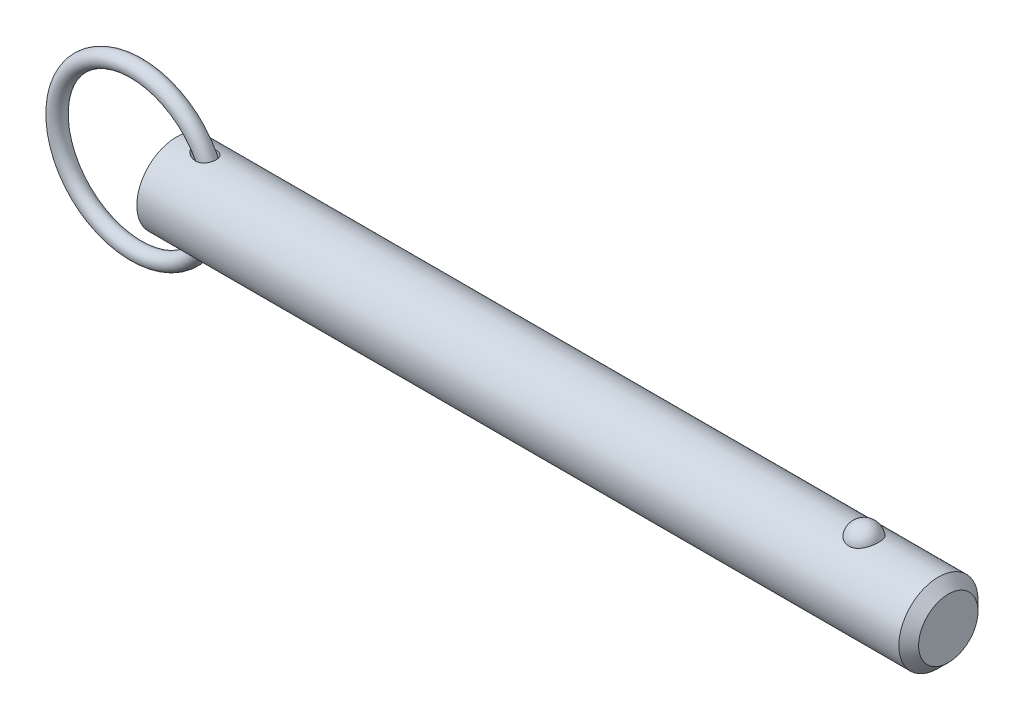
ISO-10303-21;
HEADER;
FILE_DESCRIPTION(('STEP AP214'),'2;1');
FILE_NAME('part.step','',(''),(''),'','','');
FILE_SCHEMA(('AUTOMOTIVE_DESIGN { 1 0 10303 214 1 1 1 1 }'));
ENDSEC;
DATA;
#1=APPLICATION_CONTEXT('core data for automotive mechanical design processes');
#2=APPLICATION_PROTOCOL_DEFINITION('international standard','automotive_design',2000,#1);
#3=PRODUCT_CONTEXT('',#1,'mechanical');
#4=PRODUCT('Part','Part','',(#3));
#5=PRODUCT_RELATED_PRODUCT_CATEGORY('part','',(#4));
#6=PRODUCT_DEFINITION_FORMATION('','',#4);
#7=PRODUCT_DEFINITION_CONTEXT('part definition',#1,'design');
#8=PRODUCT_DEFINITION('design','',#6,#7);
#9=PRODUCT_DEFINITION_SHAPE('','',#8);
#10=(LENGTH_UNIT() NAMED_UNIT(*) SI_UNIT(.MILLI.,.METRE.));
#11=(NAMED_UNIT(*) PLANE_ANGLE_UNIT() SI_UNIT($,.RADIAN.));
#12=(NAMED_UNIT(*) SI_UNIT($,.STERADIAN.) SOLID_ANGLE_UNIT());
#13=UNCERTAINTY_MEASURE_WITH_UNIT(LENGTH_MEASURE(1.E-05),#10,'distance_accuracy_value','');
#14=(GEOMETRIC_REPRESENTATION_CONTEXT(3) GLOBAL_UNCERTAINTY_ASSIGNED_CONTEXT((#13)) GLOBAL_UNIT_ASSIGNED_CONTEXT((#10,
#11,#12)) REPRESENTATION_CONTEXT('',''));
#15=CARTESIAN_POINT('',(0.,0.,0.));
#16=DIRECTION('',(0.,0.,1.));
#17=DIRECTION('',(1.,0.,0.));
#18=AXIS2_PLACEMENT_3D('',#15,#16,#17);
#19=CARTESIAN_POINT('',(-9.66825126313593,0.,0.));
#20=DIRECTION('',(0.,0.,1.));
#21=DIRECTION('',(1.,0.,0.));
#22=AXIS2_PLACEMENT_3D('',#19,#20,#21);
#23=TOROIDAL_SURFACE('',#22,19.05,1.905);
#24=CARTESIAN_POINT('',(11.2867487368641,0.,0.));
#25=VERTEX_POINT('',#24);
#26=VERTEX_LOOP('',#25);
#27=FACE_BOUND('',#26,.T.);
#28=ADVANCED_FACE('P0_F12',(#27),#23,.T.);
#29=CLOSED_SHELL('',(#28));
#30=MANIFOLD_SOLID_BREP('P0_B1',#29);
#31=CARTESIAN_POINT('',(0.,0.,0.));
#32=DIRECTION('',(1.,0.,0.));
#33=DIRECTION('',(0.,0.,-1.));
#34=AXIS2_PLACEMENT_3D('',#31,#32,#33);
#35=CYLINDRICAL_SURFACE('',#34,9.525);
#36=CARTESIAN_POINT('',(4.56693409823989,9.43141941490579,-1.33189820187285));
#37=CARTESIAN_POINT('',(4.70260475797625,9.41020313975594,-1.48215931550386));
#38=CARTESIAN_POINT('',(4.85555680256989,9.38755003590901,-1.61683982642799));
#39=CARTESIAN_POINT('',(5.10171959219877,9.35450554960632,-1.79512943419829));
#40=CARTESIAN_POINT('',(5.18674514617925,9.34362629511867,-1.85068909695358));
#41=CARTESIAN_POINT('',(5.3615438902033,9.32258514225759,-1.95392002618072));
#42=CARTESIAN_POINT('',(5.45131542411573,9.31242299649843,-2.00159402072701));
#43=CARTESIAN_POINT('',(5.70070211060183,9.28632120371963,-2.12033289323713));
#44=CARTESIAN_POINT('',(5.86420408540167,9.27146938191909,-2.18362944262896));
#45=CARTESIAN_POINT('',(6.19893345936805,9.24694163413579,-2.28525783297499));
#46=CARTESIAN_POINT('',(6.3701538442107,9.23726110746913,-2.32361187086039));
#47=CARTESIAN_POINT('',(6.73531776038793,9.22400982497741,-2.37575048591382));
#48=CARTESIAN_POINT('',(6.92975826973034,9.22118808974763,-2.38652934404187));
#49=CARTESIAN_POINT('',(7.21995443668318,9.22416297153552,-2.37494980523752));
#50=CARTESIAN_POINT('',(7.31643847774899,9.22635560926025,-2.366466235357));
#51=CARTESIAN_POINT('',(7.50796421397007,9.2331428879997,-2.33985028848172));
#52=CARTESIAN_POINT('',(7.6030065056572,9.23773650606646,-2.32172202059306));
#53=CARTESIAN_POINT('',(7.83273114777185,9.25183311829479,-2.26504721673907));
#54=CARTESIAN_POINT('',(7.96603028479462,9.26261470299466,-2.2209856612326));
#55=CARTESIAN_POINT('',(8.22310899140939,9.28816519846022,-2.1115730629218));
#56=CARTESIAN_POINT('',(8.34689477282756,9.30293147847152,-2.04623606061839));
#57=CARTESIAN_POINT('',(8.58136049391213,9.3349416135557,-1.89485344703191));
#58=CARTESIAN_POINT('',(8.69199721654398,9.35219324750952,-1.80874222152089));
#59=CARTESIAN_POINT('',(8.89592093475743,9.38707016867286,-1.61799188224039));
#60=CARTESIAN_POINT('',(8.98920771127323,9.40469546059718,-1.51335253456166));
#61=CARTESIAN_POINT('',(9.15057731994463,9.43713590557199,-1.29519427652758));
#62=CARTESIAN_POINT('',(9.21980158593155,9.45205440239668,-1.18253282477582));
#63=CARTESIAN_POINT('',(9.33826736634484,9.47856708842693,-0.946802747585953));
#64=CARTESIAN_POINT('',(9.38751161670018,9.49016173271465,-0.823735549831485));
#65=CARTESIAN_POINT('',(9.46423850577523,9.50859378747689,-0.57261402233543));
#66=CARTESIAN_POINT('',(9.49202393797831,9.5154972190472,-0.444656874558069));
#67=CARTESIAN_POINT('',(9.52636926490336,9.52406905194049,-0.185752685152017));
#68=CARTESIAN_POINT('',(9.53292923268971,9.52573747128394,-0.0548056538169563));
#69=CARTESIAN_POINT('',(9.52467276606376,9.52365852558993,0.20650329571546));
#70=CARTESIAN_POINT('',(9.50983454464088,9.51990564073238,0.336864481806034));
#71=CARTESIAN_POINT('',(9.45907362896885,9.50737852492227,0.593166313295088));
#72=CARTESIAN_POINT('',(9.42315106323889,9.49860432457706,0.719106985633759));
#73=CARTESIAN_POINT('',(9.3310664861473,9.4769892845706,0.96295935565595));
#74=CARTESIAN_POINT('',(9.27490839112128,9.46414923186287,1.08087260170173));
#75=CARTESIAN_POINT('',(9.14375803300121,9.43581000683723,1.30534632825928));
#76=CARTESIAN_POINT('',(9.06876720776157,9.42031103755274,1.41190767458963));
#77=CARTESIAN_POINT('',(8.90203187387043,9.38836719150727,1.61069439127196));
#78=CARTESIAN_POINT('',(8.81029913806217,9.37192298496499,1.70292975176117));
#79=CARTESIAN_POINT('',(8.6126877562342,9.33985045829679,1.87086859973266));
#80=CARTESIAN_POINT('',(8.50680947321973,9.3242221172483,1.94657251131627));
#81=CARTESIAN_POINT('',(8.28220546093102,9.29513431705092,2.08109032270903));
#82=CARTESIAN_POINT('',(8.16329919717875,9.28171415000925,2.13961034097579));
#83=CARTESIAN_POINT('',(7.91756052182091,9.25859072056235,2.23755716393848));
#84=CARTESIAN_POINT('',(7.79072606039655,9.24888842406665,2.27697900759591));
#85=CARTESIAN_POINT('',(7.52377913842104,9.23338749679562,2.33907806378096));
#86=CARTESIAN_POINT('',(7.3833476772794,9.22789571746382,2.36044900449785));
#87=CARTESIAN_POINT('',(7.1008139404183,9.22210229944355,2.3829751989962));
#88=CARTESIAN_POINT('',(6.95871103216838,9.22180269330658,2.38412253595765));
#89=CARTESIAN_POINT('',(6.65642691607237,9.22632724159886,2.36656230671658));
#90=CARTESIAN_POINT('',(6.49641694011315,9.23185415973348,2.3451317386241));
#91=CARTESIAN_POINT('',(6.18115433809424,9.24811737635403,2.28014143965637));
#92=CARTESIAN_POINT('',(6.02590710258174,9.25885936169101,2.23655754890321));
#93=CARTESIAN_POINT('',(5.69904720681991,9.28624254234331,2.12025087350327));
#94=CARTESIAN_POINT('',(5.52873601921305,9.30354853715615,2.04400672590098));
#95=CARTESIAN_POINT('',(5.20289495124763,9.34106989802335,1.86504730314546));
#96=CARTESIAN_POINT('',(5.0473596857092,9.36128419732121,1.76234172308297));
#97=CARTESIAN_POINT('',(4.79287124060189,9.39697639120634,1.55895334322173));
#98=CARTESIAN_POINT('',(4.6893870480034,9.41240250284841,1.46392900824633));
#99=CARTESIAN_POINT('',(4.4984714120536,9.44202586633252,1.25875918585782));
#100=CARTESIAN_POINT('',(4.41101129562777,9.45622528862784,1.1486413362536));
#101=CARTESIAN_POINT('',(4.27502257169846,9.47888210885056,0.940600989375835));
#102=CARTESIAN_POINT('',(4.22216329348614,9.48791121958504,0.845586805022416));
#103=CARTESIAN_POINT('',(4.13241478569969,9.50344321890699,0.648051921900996));
#104=CARTESIAN_POINT('',(4.0955118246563,9.50994827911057,0.545537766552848));
#105=CARTESIAN_POINT('',(4.04043124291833,9.51971586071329,0.334452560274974));
#106=CARTESIAN_POINT('',(4.02240728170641,9.52295176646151,0.225839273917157));
#107=CARTESIAN_POINT('',(4.00750873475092,9.52562364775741,0.00713006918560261));
#108=CARTESIAN_POINT('',(4.01062334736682,9.52506156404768,-0.102965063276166));
#109=CARTESIAN_POINT('',(4.03592967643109,9.52053221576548,-0.306944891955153));
#110=CARTESIAN_POINT('',(4.05571676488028,9.51699426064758,-0.401151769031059));
#111=CARTESIAN_POINT('',(4.10967975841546,9.5074546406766,-0.585176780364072));
#112=CARTESIAN_POINT('',(4.1438599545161,9.50145224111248,-0.674993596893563));
#113=CARTESIAN_POINT('',(4.23261356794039,9.48611703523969,-0.866116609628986));
#114=CARTESIAN_POINT('',(4.28990016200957,9.47635800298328,-0.966121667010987));
#115=CARTESIAN_POINT('',(4.4185657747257,9.45502867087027,-1.15640011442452));
#116=CARTESIAN_POINT('',(4.4899691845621,9.44345524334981,-1.24665623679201));
#117=CARTESIAN_POINT('',(4.56693409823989,9.43141941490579,-1.33189820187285));
#118=B_SPLINE_CURVE_WITH_KNOTS('',3,(#36,#37,#38,#39,#40,#41,#42,#43,#44,#45,#46,#47,#48,#49,
#50,#51,#52,#53,#54,#55,#56,#57,#58,#59,#60,#61,#62,#63,#64,#65,#66,#67,#68,#69,#70,#71,#72,#73,
#74,#75,#76,#77,#78,#79,#80,#81,#82,#83,#84,#85,#86,#87,#88,#89,#90,#91,#92,#93,#94,#95,#96,#97,
#98,#99,#100,#101,#102,#103,#104,#105,#106,#107,#108,#109,#110,#111,#112,#113,#114,#115,#116,
#117),.UNSPECIFIED.,.T.,.F.,(4,2,2,2,2,2,2,2,2,2,2,2,2,2,2,2,2,2,2,2,2,2,2,2,2,2,2,2,2,2,2,2,2,
2,2,2,2,2,2,2,4),(0.,0.609951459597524,0.916123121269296,1.22218863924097,1.74791337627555,
2.27316961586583,2.85362722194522,3.14383229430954,3.43391382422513,3.85437497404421,
4.27455920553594,4.69608835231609,5.11762282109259,5.5149005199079,5.91212379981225,
6.30363414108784,6.69514313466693,7.08705103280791,7.47895654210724,7.87078624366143,
8.26258603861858,8.65411137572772,9.04562666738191,9.44349251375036,9.84146165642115,
10.2662286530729,10.6911619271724,11.1739180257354,11.6572017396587,12.2170157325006,
12.7766249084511,13.1992556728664,13.6211226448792,13.9471990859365,14.2729943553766,
14.6014211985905,14.9296802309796,15.2173810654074,15.505167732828,15.8505863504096,
16.1966070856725),.UNSPECIFIED.);
#119=CARTESIAN_POINT('',(4.56693409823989,9.43141941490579,-1.33189820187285));
#120=VERTEX_POINT('',#119);
#121=EDGE_CURVE('P1_E40',#120,#120,#118,.T.);
#122=ORIENTED_EDGE('',*,*,#121,.T.);
#123=EDGE_LOOP('',(#122));
#124=FACE_BOUND('',#123,.T.);
#125=CARTESIAN_POINT('',(183.34875,0.,0.));
#126=DIRECTION('',(1.,0.,0.));
#127=DIRECTION('',(0.,0.,-1.));
#128=AXIS2_PLACEMENT_3D('',#125,#126,#127);
#129=CIRCLE('',#128,9.525);
#130=CARTESIAN_POINT('',(183.34875,0.,-9.525));
#131=VERTEX_POINT('',#130);
#132=EDGE_CURVE('P1_E25',#131,#131,#129,.T.);
#133=ORIENTED_EDGE('',*,*,#132,.F.);
#134=EDGE_LOOP('',(#133));
#135=FACE_BOUND('',#134,.T.);
#136=CARTESIAN_POINT('',(0.,0.,0.));
#137=DIRECTION('',(1.,0.,0.));
#138=DIRECTION('',(0.,0.,-1.));
#139=AXIS2_PLACEMENT_3D('',#136,#137,#138);
#140=CIRCLE('',#139,9.525);
#141=CARTESIAN_POINT('',(0.,0.,-9.525));
#142=VERTEX_POINT('',#141);
#143=EDGE_CURVE('P1_E9',#142,#142,#140,.T.);
#144=ORIENTED_EDGE('',*,*,#143,.T.);
#145=EDGE_LOOP('',(#144));
#146=FACE_BOUND('',#145,.T.);
#147=CARTESIAN_POINT('',(165.445757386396,8.80405803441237,3.63513233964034));
#148=CARTESIAN_POINT('',(165.351676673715,8.80405953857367,3.63513053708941));
#149=CARTESIAN_POINT('',(165.257561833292,8.80561325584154,3.63137461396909));
#150=CARTESIAN_POINT('',(165.070012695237,8.81177748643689,3.61638665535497));
#151=CARTESIAN_POINT('',(164.976578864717,8.81638992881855,3.60514990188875));
#152=CARTESIAN_POINT('',(164.697945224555,8.8346711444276,3.56024627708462));
#153=CARTESIAN_POINT('',(164.514691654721,8.85278327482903,3.5153862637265));
#154=CARTESIAN_POINT('',(164.159509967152,8.89871214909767,3.39742145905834));
#155=CARTESIAN_POINT('',(163.987553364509,8.92650327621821,3.32439116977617));
#156=CARTESIAN_POINT('',(163.658707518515,8.98874819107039,3.15220244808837));
#157=CARTESIAN_POINT('',(163.501811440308,9.02319893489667,3.05305594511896));
#158=CARTESIAN_POINT('',(163.202214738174,9.09629186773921,2.82797815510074));
#159=CARTESIAN_POINT('',(163.060060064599,9.13502685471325,2.70135138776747));
#160=CARTESIAN_POINT('',(162.798299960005,9.2118657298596,2.42641932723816));
#161=CARTESIAN_POINT('',(162.678701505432,9.24996941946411,2.2781073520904));
#162=CARTESIAN_POINT('',(162.459645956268,9.32341082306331,1.95652290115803));
#163=CARTESIAN_POINT('',(162.361317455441,9.35855090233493,1.78243511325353));
#164=CARTESIAN_POINT('',(162.193819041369,9.42045142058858,1.41937246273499));
#165=CARTESIAN_POINT('',(162.124651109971,9.44721128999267,1.23039658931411));
#166=CARTESIAN_POINT('',(162.016199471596,9.48990641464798,0.84037088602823));
#167=CARTESIAN_POINT('',(161.977288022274,9.50570658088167,0.639202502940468));
#168=CARTESIAN_POINT('',(161.931555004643,9.52433146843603,0.2326643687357));
#169=CARTESIAN_POINT('',(161.924732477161,9.52715657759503,0.027294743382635));
#170=CARTESIAN_POINT('',(161.943255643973,9.51956918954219,-0.380478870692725));
#171=CARTESIAN_POINT('',(161.968405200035,9.50923740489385,-0.582893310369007));
#172=CARTESIAN_POINT('',(162.05002537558,9.47651897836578,-0.980293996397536));
#173=CARTESIAN_POINT('',(162.106496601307,9.45413210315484,-1.17528009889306));
#174=CARTESIAN_POINT('',(162.249719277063,9.39954044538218,-1.55263697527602));
#175=CARTESIAN_POINT('',(162.336512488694,9.36732213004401,-1.73498993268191));
#176=CARTESIAN_POINT('',(162.538610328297,9.29640700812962,-2.08177763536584));
#177=CARTESIAN_POINT('',(162.653917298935,9.25770966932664,-2.24621090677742));
#178=CARTESIAN_POINT('',(162.911264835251,9.17775604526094,-2.5533833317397));
#179=CARTESIAN_POINT('',(163.053434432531,9.136488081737,-2.696011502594));
#180=CARTESIAN_POINT('',(163.36089985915,9.05620497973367,-2.95451229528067));
#181=CARTESIAN_POINT('',(163.526193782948,9.01718965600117,-3.07038711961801));
#182=CARTESIAN_POINT('',(163.872052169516,8.94680019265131,-3.26976836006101));
#183=CARTESIAN_POINT('',(164.052227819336,8.91528408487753,-3.35389750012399));
#184=CARTESIAN_POINT('',(164.425651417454,8.86272514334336,-3.49043503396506));
#185=CARTESIAN_POINT('',(164.618894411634,8.84167836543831,-3.54285537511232));
#186=CARTESIAN_POINT('',(165.002503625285,8.81348056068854,-3.61241306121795));
#187=CARTESIAN_POINT('',(165.192525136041,8.80568348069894,-3.6311933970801));
#188=CARTESIAN_POINT('',(165.573190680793,8.80289410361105,-3.63795342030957));
#189=CARTESIAN_POINT('',(165.763834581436,8.80789922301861,-3.62593932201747));
#190=CARTESIAN_POINT('',(166.134007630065,8.82974915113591,-3.57238430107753));
#191=CARTESIAN_POINT('',(166.313697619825,8.84621463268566,-3.53178890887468));
#192=CARTESIAN_POINT('',(166.663422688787,8.88875330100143,-3.42331083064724));
#193=CARTESIAN_POINT('',(166.833456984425,8.91482726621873,-3.35542593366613));
#194=CARTESIAN_POINT('',(167.163237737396,8.97448239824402,-3.19248225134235));
#195=CARTESIAN_POINT('',(167.322680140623,9.00821446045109,-3.0968647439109));
#196=CARTESIAN_POINT('',(167.623513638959,9.07935398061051,-2.88162736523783));
#197=CARTESIAN_POINT('',(167.764900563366,9.11676228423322,-2.76200196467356));
#198=CARTESIAN_POINT('',(168.03331931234,9.19347419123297,-2.49516285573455));
#199=CARTESIAN_POINT('',(168.159275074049,9.23277872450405,-2.34686614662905));
#200=CARTESIAN_POINT('',(168.385522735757,9.30737610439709,-2.03093683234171));
#201=CARTESIAN_POINT('',(168.48581004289,9.34266823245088,-1.86330077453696));
#202=CARTESIAN_POINT('',(168.661514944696,9.40674710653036,-1.50744893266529));
#203=CARTESIAN_POINT('',(168.736041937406,9.43529176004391,-1.31874876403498));
#204=CARTESIAN_POINT('',(168.85416505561,9.48144132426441,-0.930631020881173));
#205=CARTESIAN_POINT('',(168.897760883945,9.49904612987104,-0.731213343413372));
#206=CARTESIAN_POINT('',(168.953158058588,9.5215314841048,-0.327147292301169));
#207=CARTESIAN_POINT('',(168.964935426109,9.52640243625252,-0.122495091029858));
#208=CARTESIAN_POINT('',(168.956382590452,9.52289571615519,0.28601848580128));
#209=CARTESIAN_POINT('',(168.93605305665,9.51451832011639,0.489879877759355));
#210=CARTESIAN_POINT('',(168.863884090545,9.48544083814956,0.889994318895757));
#211=CARTESIAN_POINT('',(168.812199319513,9.46480124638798,1.08627971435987));
#212=CARTESIAN_POINT('',(168.678491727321,9.4133389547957,1.46682086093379));
#213=CARTESIAN_POINT('',(168.596466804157,9.38251554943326,1.65107577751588));
#214=CARTESIAN_POINT('',(168.40319292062,9.31365636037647,2.00346348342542));
#215=CARTESIAN_POINT('',(168.291783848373,9.27558138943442,2.17150083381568));
#216=CARTESIAN_POINT('',(168.042294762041,9.19638714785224,2.48563115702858));
#217=CARTESIAN_POINT('',(167.904216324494,9.15526805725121,2.63172542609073));
#218=CARTESIAN_POINT('',(167.604843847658,9.07465393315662,2.89750997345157));
#219=CARTESIAN_POINT('',(167.443610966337,9.03515496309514,3.01726776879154));
#220=CARTESIAN_POINT('',(167.101613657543,8.96227564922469,3.22732920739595));
#221=CARTESIAN_POINT('',(166.920841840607,8.92889763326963,3.31762165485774));
#222=CARTESIAN_POINT('',(166.551445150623,8.8734538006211,3.46314419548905));
#223=CARTESIAN_POINT('',(166.36332371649,8.85102983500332,3.51950082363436));
#224=CARTESIAN_POINT('',(166.07578699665,8.8266696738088,3.57993683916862));
#225=CARTESIAN_POINT('',(165.979133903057,8.82009725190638,3.5960621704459));
#226=CARTESIAN_POINT('',(165.784677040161,8.81020897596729,3.62022512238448));
#227=CARTESIAN_POINT('',(165.68687410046,8.80689090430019,3.62826825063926));
#228=CARTESIAN_POINT('',(165.541224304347,8.80445615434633,3.63416760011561));
#229=CARTESIAN_POINT('',(165.493495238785,8.80405727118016,3.63513325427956));
#230=CARTESIAN_POINT('',(165.445757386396,8.80405803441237,3.63513233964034));
#231=B_SPLINE_CURVE_WITH_KNOTS('',3,(#147,#148,#149,#150,#151,#152,#153,#154,#155,#156,#157,
#158,#159,#160,#161,#162,#163,#164,#165,#166,#167,#168,#169,#170,#171,#172,#173,#174,#175,#176,
#177,#178,#179,#180,#181,#182,#183,#184,#185,#186,#187,#188,#189,#190,#191,#192,#193,#194,#195,
#196,#197,#198,#199,#200,#201,#202,#203,#204,#205,#206,#207,#208,#209,#210,#211,#212,#213,#214,
#215,#216,#217,#218,#219,#220,#221,#222,#223,#224,#225,#226,#227,#228,#229,#230),.UNSPECIFIED.,
.T.,.F.,(4,2,2,2,2,2,2,2,2,2,2,2,2,2,2,2,2,2,2,2,2,2,2,2,2,2,2,2,2,2,2,2,2,2,2,2,2,2,2,2,2,4),
(0.,0.282202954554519,0.564584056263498,1.13017050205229,1.69427128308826,2.25811483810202,
2.83836627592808,3.41879688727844,4.02497117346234,4.63118665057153,5.2447475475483,
5.85829010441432,6.46808687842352,7.07789545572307,7.68854723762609,8.299249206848,
8.91296283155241,9.52662591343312,10.1275338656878,10.7282152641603,11.2986646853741,
11.8689989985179,12.4213015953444,12.973648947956,13.5380053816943,14.1024919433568,
14.695298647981,15.2882113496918,15.8999469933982,16.5116885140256,17.1238909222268,
17.7360805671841,18.3452748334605,18.9545113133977,19.567138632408,20.179729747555,
20.7907316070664,21.4019653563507,21.9915938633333,22.2859053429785,22.5800161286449,
22.7232098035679),.UNSPECIFIED.);
#232=CARTESIAN_POINT('',(165.445757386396,8.80405803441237,3.63513233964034));
#233=VERTEX_POINT('',#232);
#234=EDGE_CURVE('P1_E34',#233,#233,#231,.T.);
#235=ORIENTED_EDGE('',*,*,#234,.T.);
#236=EDGE_LOOP('',(#235));
#237=FACE_BOUND('',#236,.T.);
#238=CARTESIAN_POINT('',(4.56693409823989,-9.43141941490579,-1.33189820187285));
#239=CARTESIAN_POINT('',(4.48932984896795,-9.4435553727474,-1.24594548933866));
#240=CARTESIAN_POINT('',(4.41737309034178,-9.45522193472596,-1.1548795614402));
#241=CARTESIAN_POINT('',(4.28781047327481,-9.47670896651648,-0.962782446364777));
#242=CARTESIAN_POINT('',(4.23019403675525,-9.48653079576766,-0.861758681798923));
#243=CARTESIAN_POINT('',(4.132545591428,-9.5034118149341,-0.649723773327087));
#244=CARTESIAN_POINT('',(4.09271158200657,-9.51043980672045,-0.538615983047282));
#245=CARTESIAN_POINT('',(4.04973167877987,-9.51806966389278,-0.367764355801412));
#246=CARTESIAN_POINT('',(4.03820037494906,-9.52012756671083,-0.310118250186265));
#247=CARTESIAN_POINT('',(4.02100287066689,-9.52320274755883,-0.193935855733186));
#248=CARTESIAN_POINT('',(4.01533565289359,-9.52422020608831,-0.135399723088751));
#249=CARTESIAN_POINT('',(4.0081707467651,-9.52550497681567,0.0247266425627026));
#250=CARTESIAN_POINT('',(4.0127049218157,-9.52468821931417,0.126661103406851));
#251=CARTESIAN_POINT('',(4.03954973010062,-9.51988506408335,0.328012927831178));
#252=CARTESIAN_POINT('',(4.06186450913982,-9.51589792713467,0.42742969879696));
#253=CARTESIAN_POINT('',(4.12088980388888,-9.5054852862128,0.616362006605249));
#254=CARTESIAN_POINT('',(4.15684838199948,-9.49918763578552,0.706123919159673));
#255=CARTESIAN_POINT('',(4.24094647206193,-9.48470618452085,0.879522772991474));
#256=CARTESIAN_POINT('',(4.28909090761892,-9.47652162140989,0.96315722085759));
#257=CARTESIAN_POINT('',(4.42295891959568,-9.45426317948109,1.16513741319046));
#258=CARTESIAN_POINT('',(4.51523752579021,-9.43933320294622,1.27905352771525));
#259=CARTESIAN_POINT('',(4.71682295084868,-9.40825940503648,1.49055892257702));
#260=CARTESIAN_POINT('',(4.82617286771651,-9.39211256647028,1.58810554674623));
#261=CARTESIAN_POINT('',(5.09064226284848,-9.35555264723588,1.79246125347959));
#262=CARTESIAN_POINT('',(5.2499041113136,-9.33524115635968,1.89393122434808));
#263=CARTESIAN_POINT('',(5.58309255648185,-9.29785396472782,2.06968659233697));
#264=CARTESIAN_POINT('',(5.75702897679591,-9.28078045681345,2.14395359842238));
#265=CARTESIAN_POINT('',(6.11646882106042,-9.25213303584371,2.26440412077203));
#266=CARTESIAN_POINT('',(6.30205582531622,-9.2406056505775,2.31035092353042));
#267=CARTESIAN_POINT('',(6.67856093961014,-9.22541807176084,2.37029728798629));
#268=CARTESIAN_POINT('',(6.8694704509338,-9.2217458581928,2.3843456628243));
#269=CARTESIAN_POINT('',(7.21217144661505,-9.22344239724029,2.37775005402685));
#270=CARTESIAN_POINT('',(7.36409439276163,-9.22713860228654,2.36352577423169));
#271=CARTESIAN_POINT('',(7.66346227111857,-9.24048072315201,2.31082299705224));
#272=CARTESIAN_POINT('',(7.81090958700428,-9.25012341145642,2.27235765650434));
#273=CARTESIAN_POINT('',(8.09730316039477,-9.2746609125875,2.17003648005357));
#274=CARTESIAN_POINT('',(8.2361965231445,-9.28958517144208,2.10603803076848));
#275=CARTESIAN_POINT('',(8.49918675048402,-9.32290326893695,1.95324442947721));
#276=CARTESIAN_POINT('',(8.62328895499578,-9.34129584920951,1.86445826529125));
#277=CARTESIAN_POINT('',(8.84006515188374,-9.37706953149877,1.67466761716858));
#278=CARTESIAN_POINT('',(8.93465172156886,-9.39436331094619,1.57582357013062));
#279=CARTESIAN_POINT('',(9.10490234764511,-9.42761680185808,1.362809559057));
#280=CARTESIAN_POINT('',(9.18057146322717,-9.44357686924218,1.24864370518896));
#281=CARTESIAN_POINT('',(9.30789178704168,-9.47159985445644,1.01379272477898));
#282=CARTESIAN_POINT('',(9.36045544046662,-9.48380365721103,0.893617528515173));
#283=CARTESIAN_POINT('',(9.44498362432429,-9.50388751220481,0.645890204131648));
#284=CARTESIAN_POINT('',(9.47694947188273,-9.51176784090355,0.518338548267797));
#285=CARTESIAN_POINT('',(9.51944262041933,-9.52232073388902,0.260103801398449));
#286=CARTESIAN_POINT('',(9.53006646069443,-9.52501674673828,0.129437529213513));
#287=CARTESIAN_POINT('',(9.52993291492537,-9.52498309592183,-0.131885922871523));
#288=CARTESIAN_POINT('',(9.51917525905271,-9.52225336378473,-0.26254310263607));
#289=CARTESIAN_POINT('',(9.47648788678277,-9.51165418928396,-0.520312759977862));
#290=CARTESIAN_POINT('',(9.44453086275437,-9.50377811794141,-0.647420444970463));
#291=CARTESIAN_POINT('',(9.36015568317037,-9.48373425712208,-0.89429087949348));
#292=CARTESIAN_POINT('',(9.30773827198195,-9.47156662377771,-1.01405389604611));
#293=CARTESIAN_POINT('',(9.1838089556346,-9.44428888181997,-1.24269386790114));
#294=CARTESIAN_POINT('',(9.11232064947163,-9.42918241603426,-1.3515840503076));
#295=CARTESIAN_POINT('',(8.9521268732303,-9.39767706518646,-1.55562459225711));
#296=CARTESIAN_POINT('',(8.86342281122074,-9.3812782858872,-1.65077607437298));
#297=CARTESIAN_POINT('',(8.6710444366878,-9.34891827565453,-1.82517515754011));
#298=CARTESIAN_POINT('',(8.56732858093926,-9.33295841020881,-1.90437711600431));
#299=CARTESIAN_POINT('',(8.34818438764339,-9.30317889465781,-2.0449122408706));
#300=CARTESIAN_POINT('',(8.23275529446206,-9.28935938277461,-2.10624425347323));
#301=CARTESIAN_POINT('',(7.98961240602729,-9.26475003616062,-2.2120340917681));
#302=CARTESIAN_POINT('',(7.86162088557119,-9.25407358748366,-2.25587700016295));
#303=CARTESIAN_POINT('',(7.60027499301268,-9.23720810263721,-2.32397032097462));
#304=CARTESIAN_POINT('',(7.46691858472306,-9.23102078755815,-2.34821321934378));
#305=CARTESIAN_POINT('',(7.18516230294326,-9.22302718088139,-2.37943079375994));
#306=CARTESIAN_POINT('',(7.03654454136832,-9.22169704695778,-2.38452997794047));
#307=CARTESIAN_POINT('',(6.74015049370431,-9.22442327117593,-2.37395141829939));
#308=CARTESIAN_POINT('',(6.59237455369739,-9.22848170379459,-2.35826567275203));
#309=CARTESIAN_POINT('',(6.27762777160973,-9.2422287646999,-2.30385559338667));
#310=CARTESIAN_POINT('',(6.11124715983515,-9.25269504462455,-2.26192683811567));
#311=CARTESIAN_POINT('',(5.78635920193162,-9.27830776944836,-2.15445569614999));
#312=CARTESIAN_POINT('',(5.62786567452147,-9.29346211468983,-2.08887341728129));
#313=CARTESIAN_POINT('',(5.39013065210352,-9.31931237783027,-1.96924953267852));
#314=CARTESIAN_POINT('',(5.30683088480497,-9.32901725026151,-1.92292485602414));
#315=CARTESIAN_POINT('',(5.1445580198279,-9.34899035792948,-1.82334419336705));
#316=CARTESIAN_POINT('',(5.06558607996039,-9.35925874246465,-1.77008636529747));
#317=CARTESIAN_POINT('',(4.83670950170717,-9.39034445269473,-1.60010986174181));
#318=CARTESIAN_POINT('',(4.69422471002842,-9.41151337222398,-1.47288240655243));
#319=CARTESIAN_POINT('',(4.56693409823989,-9.43141941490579,-1.33189820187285));
#320=B_SPLINE_CURVE_WITH_KNOTS('',3,(#238,#239,#240,#241,#242,#243,#244,#245,#246,#247,#248,
#249,#250,#251,#252,#253,#254,#255,#256,#257,#258,#259,#260,#261,#262,#263,#264,#265,#266,#267,
#268,#269,#270,#271,#272,#273,#274,#275,#276,#277,#278,#279,#280,#281,#282,#283,#284,#285,#286,
#287,#288,#289,#290,#291,#292,#293,#294,#295,#296,#297,#298,#299,#300,#301,#302,#303,#304,#305,
#306,#307,#308,#309,#310,#311,#312,#313,#314,#315,#316,#317,#318,#319),.UNSPECIFIED.,.T.,.F.,(4,
2,2,2,2,2,2,2,2,2,2,2,2,2,2,2,2,2,2,2,2,2,2,2,2,2,2,2,2,2,2,2,2,2,2,2,2,2,2,2,4),(0.,
0.348900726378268,0.697543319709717,1.0499765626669,1.22617690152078,1.40234666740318,
1.70666745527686,2.01105922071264,2.30066493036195,2.59038784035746,3.03001384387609,
3.4707682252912,4.03766594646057,4.60494622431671,5.17690598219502,5.74798989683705,
6.20400848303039,6.65977977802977,7.11813321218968,7.57632066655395,7.98791759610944,
8.39940433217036,8.7927345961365,9.18603970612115,9.577561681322,9.9690885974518,
10.3611208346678,10.7531388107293,11.1446739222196,11.536177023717,11.9287850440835,
12.3214184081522,12.7268448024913,13.1324265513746,13.5768390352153,14.0214226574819,
14.5351685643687,15.0497849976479,15.3368801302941,15.6240516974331,16.1963372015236),.UNSPECIFIED.);
#321=CARTESIAN_POINT('',(4.56693409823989,-9.43141941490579,-1.33189820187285));
#322=VERTEX_POINT('',#321);
#323=EDGE_CURVE('P1_E17',#322,#322,#320,.T.);
#324=ORIENTED_EDGE('',*,*,#323,.T.);
#325=EDGE_LOOP('',(#324));
#326=FACE_BOUND('',#325,.T.);
#327=ADVANCED_FACE('P1_F13',(#124,#135,#146,#237,#326),#35,.T.);
#328=CARTESIAN_POINT('',(0.,0.,0.));
#329=DIRECTION('',(-1.,0.,0.));
#330=DIRECTION('',(0.,0.,1.));
#331=AXIS2_PLACEMENT_3D('',#328,#329,#330);
#332=PLANE('',#331);
#333=ORIENTED_EDGE('',*,*,#143,.F.);
#334=EDGE_LOOP('',(#333));
#335=FACE_BOUND('',#334,.T.);
#336=ADVANCED_FACE('P1_F15',(#335),#332,.T.);
#337=CARTESIAN_POINT('',(185.73,0.,0.));
#338=DIRECTION('',(-1.,0.,0.));
#339=DIRECTION('',(0.,0.,1.));
#340=AXIS2_PLACEMENT_3D('',#337,#338,#339);
#341=CONICAL_SURFACE('',#340,7.14375000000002,0.785398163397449);
#342=ORIENTED_EDGE('',*,*,#132,.T.);
#343=EDGE_LOOP('',(#342));
#344=FACE_BOUND('',#343,.T.);
#345=CARTESIAN_POINT('',(185.73,0.,0.));
#346=DIRECTION('',(1.,0.,0.));
#347=DIRECTION('',(0.,0.,-1.));
#348=AXIS2_PLACEMENT_3D('',#345,#346,#347);
#349=CIRCLE('',#348,7.14375000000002);
#350=CARTESIAN_POINT('',(185.73,0.,-7.14375000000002));
#351=VERTEX_POINT('',#350);
#352=EDGE_CURVE('P1_E30',#351,#351,#349,.T.);
#353=ORIENTED_EDGE('',*,*,#352,.F.);
#354=EDGE_LOOP('',(#353));
#355=FACE_BOUND('',#354,.T.);
#356=ADVANCED_FACE('P1_F55',(#344,#355),#341,.T.);
#357=CARTESIAN_POINT('',(185.73,7.14375000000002,0.));
#358=DIRECTION('',(1.,0.,0.));
#359=DIRECTION('',(0.,0.,-1.));
#360=AXIS2_PLACEMENT_3D('',#357,#358,#359);
#361=PLANE('',#360);
#362=ORIENTED_EDGE('',*,*,#352,.T.);
#363=EDGE_LOOP('',(#362));
#364=FACE_BOUND('',#363,.T.);
#365=ADVANCED_FACE('P1_F51',(#364),#361,.T.);
#366=CARTESIAN_POINT('',(165.445757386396,8.57249999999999,0.));
#367=DIRECTION('',(-1.,0.,0.));
#368=DIRECTION('',(0.,1.,0.));
#369=AXIS2_PLACEMENT_3D('',#366,#367,#368);
#370=SPHERICAL_SURFACE('',#369,3.64249999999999);
#371=ORIENTED_EDGE('',*,*,#234,.F.);
#372=EDGE_LOOP('',(#371));
#373=FACE_BOUND('',#372,.T.);
#374=ADVANCED_FACE('P1_F46',(#373),#370,.T.);
#375=CARTESIAN_POINT('',(-9.66825126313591,0.,0.));
#376=DIRECTION('',(0.,0.,1.));
#377=DIRECTION('',(1.,0.,0.));
#378=AXIS2_PLACEMENT_3D('',#375,#376,#377);
#379=TOROIDAL_SURFACE('',#378,19.05,2.38125);
#380=ORIENTED_EDGE('',*,*,#323,.F.);
#381=EDGE_LOOP('',(#380));
#382=FACE_BOUND('',#381,.T.);
#383=ORIENTED_EDGE('',*,*,#121,.F.);
#384=EDGE_LOOP('',(#383));
#385=FACE_BOUND('',#384,.T.);
#386=ADVANCED_FACE('P1_F50',(#382,#385),#379,.F.);
#387=CLOSED_SHELL('',(#327,#336,#356,#365,#374,#386));
#388=MANIFOLD_SOLID_BREP('P1_B1',#387);
#389=ADVANCED_BREP_SHAPE_REPRESENTATION('',(#18,#30,#388),#14);
#390=SHAPE_DEFINITION_REPRESENTATION(#9,#389);
ENDSEC;
END-ISO-10303-21;
